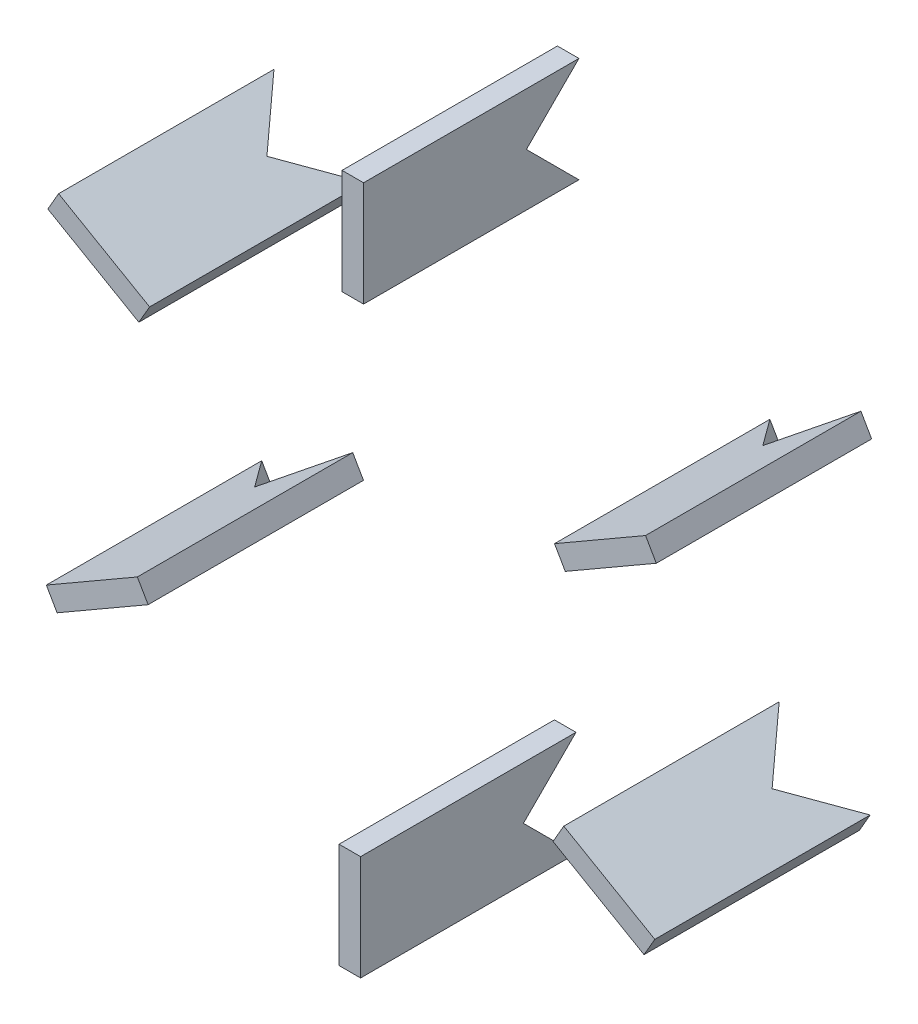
ISO-10303-21;
HEADER;
FILE_DESCRIPTION(('STEP AP214'),'2;1');
FILE_NAME('part.step','',(''),(''),'','','');
FILE_SCHEMA(('AUTOMOTIVE_DESIGN { 1 0 10303 214 1 1 1 1 }'));
ENDSEC;
DATA;
#1=APPLICATION_CONTEXT('core data for automotive mechanical design processes');
#2=APPLICATION_PROTOCOL_DEFINITION('international standard','automotive_design',2000,#1);
#3=PRODUCT_CONTEXT('',#1,'mechanical');
#4=PRODUCT('Part','Part','',(#3));
#5=PRODUCT_RELATED_PRODUCT_CATEGORY('part','',(#4));
#6=PRODUCT_DEFINITION_FORMATION('','',#4);
#7=PRODUCT_DEFINITION_CONTEXT('part definition',#1,'design');
#8=PRODUCT_DEFINITION('design','',#6,#7);
#9=PRODUCT_DEFINITION_SHAPE('','',#8);
#10=(LENGTH_UNIT() NAMED_UNIT(*) SI_UNIT(.MILLI.,.METRE.));
#11=(NAMED_UNIT(*) PLANE_ANGLE_UNIT() SI_UNIT($,.RADIAN.));
#12=(NAMED_UNIT(*) SI_UNIT($,.STERADIAN.) SOLID_ANGLE_UNIT());
#13=UNCERTAINTY_MEASURE_WITH_UNIT(LENGTH_MEASURE(1.E-05),#10,'distance_accuracy_value','');
#14=(GEOMETRIC_REPRESENTATION_CONTEXT(3) GLOBAL_UNCERTAINTY_ASSIGNED_CONTEXT((#13)) GLOBAL_UNIT_ASSIGNED_CONTEXT((#10,
#11,#12)) REPRESENTATION_CONTEXT('',''));
#15=CARTESIAN_POINT('',(0.,0.,0.));
#16=DIRECTION('',(0.,0.,1.));
#17=DIRECTION('',(1.,0.,0.));
#18=AXIS2_PLACEMENT_3D('',#15,#16,#17);
#19=CARTESIAN_POINT('',(0.575310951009,1.25354595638,0.));
#20=DIRECTION('',(0.50000000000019,0.866025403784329,0.));
#21=DIRECTION('',(-0.866025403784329,0.50000000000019,0.));
#22=AXIS2_PLACEMENT_3D('',#19,#20,#21);
#23=PLANE('',#22);
#24=DIRECTION('',(0.,0.,1.));
#25=VECTOR('',#24,1.);
#26=CARTESIAN_POINT('',(-34.1523077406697,21.3035459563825,19.984));
#27=LINE('',#26,#25);
#28=CARTESIAN_POINT('',(-34.1523077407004,21.3035459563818,44.984));
#29=VERTEX_POINT('',#28);
#30=CARTESIAN_POINT('',(-34.152307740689,21.3035459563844,19.9839999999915));
#31=VERTEX_POINT('',#30);
#32=EDGE_CURVE('P0_E88',#29,#31,#27,.F.);
#33=ORIENTED_EDGE('',*,*,#32,.F.);
#34=DIRECTION('',(0.866025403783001,-0.50000000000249,0.));
#35=VECTOR('',#34,1.);
#36=CARTESIAN_POINT('',(-34.1523077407,21.3035459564,44.984));
#37=LINE('',#36,#35);
#38=CARTESIAN_POINT('',(-23.5867978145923,15.2035459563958,44.984));
#39=VERTEX_POINT('',#38);
#40=EDGE_CURVE('P0_E60',#29,#39,#37,.T.);
#41=ORIENTED_EDGE('',*,*,#40,.T.);
#42=DIRECTION('',(0.,0.,1.));
#43=VECTOR('',#42,1.);
#44=CARTESIAN_POINT('',(-23.5867978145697,15.2035459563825,44.984));
#45=LINE('',#44,#43);
#46=CARTESIAN_POINT('',(-23.5867978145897,15.2035459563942,19.9840000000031));
#47=VERTEX_POINT('',#46);
#48=EDGE_CURVE('P0_E56',#47,#39,#45,.T.);
#49=ORIENTED_EDGE('',*,*,#48,.F.);
#50=DIRECTION('',(-0.612372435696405,0.353553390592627,0.707106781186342));
#51=VECTOR('',#50,1.);
#52=CARTESIAN_POINT('',(-23.5867978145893,15.2035459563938,19.9840000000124));
#53=LINE('',#52,#51);
#54=CARTESIAN_POINT('',(-28.869552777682,18.2535459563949,26.0839999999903));
#55=VERTEX_POINT('',#54);
#56=EDGE_CURVE('P0_E73',#47,#55,#53,.T.);
#57=ORIENTED_EDGE('',*,*,#56,.T.);
#58=DIRECTION('',(-0.612372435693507,0.353553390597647,-0.707106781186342));
#59=VECTOR('',#58,1.);
#60=CARTESIAN_POINT('',(-28.8695527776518,18.2535459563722,26.0839999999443));
#61=LINE('',#60,#59);
#62=EDGE_CURVE('P0_E82',#55,#31,#61,.T.);
#63=ORIENTED_EDGE('',*,*,#62,.T.);
#64=EDGE_LOOP('',(#33,#41,#49,#57,#63));
#65=FACE_BOUND('',#64,.T.);
#66=ADVANCED_FACE('P0_F16',(#65),#23,.T.);
#67=CARTESIAN_POINT('',(-24.2117978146,14.1210142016,44.984));
#68=DIRECTION('',(0.866025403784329,-0.50000000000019,0.));
#69=DIRECTION('',(0.50000000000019,0.866025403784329,0.));
#70=AXIS2_PLACEMENT_3D('',#67,#68,#69);
#71=PLANE('',#70);
#72=DIRECTION('',(0.499999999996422,0.866025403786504,3.64847041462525E-12));
#73=VECTOR('',#72,1.);
#74=CARTESIAN_POINT('',(-24.8367978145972,13.0384824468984,19.9840000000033));
#75=LINE('',#74,#73);
#76=CARTESIAN_POINT('',(-24.8367978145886,13.038482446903,19.9840000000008));
#77=VERTEX_POINT('',#76);
#78=EDGE_CURVE('P0_E76',#77,#47,#75,.T.);
#79=ORIENTED_EDGE('',*,*,#78,.T.);
#80=ORIENTED_EDGE('',*,*,#48,.T.);
#81=DIRECTION('',(-0.499999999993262,-0.866025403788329,0.));
#82=VECTOR('',#81,1.);
#83=CARTESIAN_POINT('',(-23.5867978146,15.2035459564,44.984));
#84=LINE('',#83,#82);
#85=CARTESIAN_POINT('',(-24.8367978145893,13.0384824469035,44.984));
#86=VERTEX_POINT('',#85);
#87=EDGE_CURVE('P0_E93',#39,#86,#84,.T.);
#88=ORIENTED_EDGE('',*,*,#87,.T.);
#89=DIRECTION('',(0.,0.,1.));
#90=VECTOR('',#89,1.);
#91=CARTESIAN_POINT('',(-24.8367978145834,13.0384824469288,0.));
#92=LINE('',#91,#90);
#93=EDGE_CURVE('P0_E20',#86,#77,#92,.F.);
#94=ORIENTED_EDGE('',*,*,#93,.T.);
#95=EDGE_LOOP('',(#79,#80,#88,#94));
#96=FACE_BOUND('',#95,.T.);
#97=ADVANCED_FACE('P0_F81',(#96),#71,.T.);
#98=CARTESIAN_POINT('',(-29.4945527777,17.1710142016,26.084));
#99=DIRECTION('',(0.612372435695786,-0.353553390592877,0.707106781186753));
#100=DIRECTION('',(0.755928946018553,0.,-0.654653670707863));
#101=AXIS2_PLACEMENT_3D('',#98,#99,#100);
#102=PLANE('',#101);
#103=DIRECTION('',(-0.612372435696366,0.353553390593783,0.707106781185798));
#104=VECTOR('',#103,1.);
#105=CARTESIAN_POINT('',(-24.8367978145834,13.0384824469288,19.984));
#106=LINE('',#105,#104);
#107=CARTESIAN_POINT('',(-30.1195527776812,16.0884824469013,26.0839999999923));
#108=VERTEX_POINT('',#107);
#109=EDGE_CURVE('P0_E100',#77,#108,#106,.T.);
#110=ORIENTED_EDGE('',*,*,#109,.T.);
#111=DIRECTION('',(0.499999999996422,0.866025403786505,-3.64985819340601E-12));
#112=VECTOR('',#111,1.);
#113=CARTESIAN_POINT('',(-30.1195527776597,16.0884824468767,26.0839999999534));
#114=LINE('',#113,#112);
#115=EDGE_CURVE('P0_E77',#108,#55,#114,.T.);
#116=ORIENTED_EDGE('',*,*,#115,.T.);
#117=ORIENTED_EDGE('',*,*,#56,.F.);
#118=ORIENTED_EDGE('',*,*,#78,.F.);
#119=EDGE_LOOP('',(#110,#116,#117,#118));
#120=FACE_BOUND('',#119,.T.);
#121=ADVANCED_FACE('P0_F75',(#120),#102,.F.);
#122=CARTESIAN_POINT('',(-34.7773077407,20.2210142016,19.984));
#123=DIRECTION('',(-0.612372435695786,0.353553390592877,0.707106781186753));
#124=DIRECTION('',(0.755928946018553,0.,0.654653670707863));
#125=AXIS2_PLACEMENT_3D('',#122,#123,#124);
#126=PLANE('',#125);
#127=DIRECTION('',(-0.612372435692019,0.353553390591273,-0.707106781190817));
#128=VECTOR('',#127,1.);
#129=CARTESIAN_POINT('',(-30.119552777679,16.0884824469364,26.084));
#130=LINE('',#129,#128);
#131=CARTESIAN_POINT('',(-35.4023077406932,19.1384824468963,19.983999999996));
#132=VERTEX_POINT('',#131);
#133=EDGE_CURVE('P0_E98',#108,#132,#130,.T.);
#134=ORIENTED_EDGE('',*,*,#133,.T.);
#135=DIRECTION('',(-0.50000000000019,-0.866025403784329,0.));
#136=VECTOR('',#135,1.);
#137=CARTESIAN_POINT('',(-34.7773077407,20.2210142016,19.984));
#138=LINE('',#137,#136);
#139=EDGE_CURVE('P0_E86',#31,#132,#138,.T.);
#140=ORIENTED_EDGE('',*,*,#139,.F.);
#141=ORIENTED_EDGE('',*,*,#62,.F.);
#142=ORIENTED_EDGE('',*,*,#115,.F.);
#143=EDGE_LOOP('',(#134,#140,#141,#142));
#144=FACE_BOUND('',#143,.T.);
#145=ADVANCED_FACE('P0_F105',(#144),#126,.F.);
#146=CARTESIAN_POINT('',(-34.7773077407,20.2210142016,19.984));
#147=DIRECTION('',(-0.866025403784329,0.50000000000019,0.));
#148=DIRECTION('',(-0.50000000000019,-0.866025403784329,0.));
#149=AXIS2_PLACEMENT_3D('',#146,#147,#148);
#150=PLANE('',#149);
#151=DIRECTION('',(0.499999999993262,0.866025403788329,0.));
#152=VECTOR('',#151,1.);
#153=CARTESIAN_POINT('',(-35.4023077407,19.1384824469,44.984));
#154=LINE('',#153,#152);
#155=CARTESIAN_POINT('',(-35.4023077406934,19.1384824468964,44.984));
#156=VERTEX_POINT('',#155);
#157=EDGE_CURVE('P0_E34',#156,#29,#154,.T.);
#158=ORIENTED_EDGE('',*,*,#157,.T.);
#159=ORIENTED_EDGE('',*,*,#32,.T.);
#160=ORIENTED_EDGE('',*,*,#139,.T.);
#161=DIRECTION('',(0.,0.,1.));
#162=VECTOR('',#161,1.);
#163=CARTESIAN_POINT('',(-35.4023077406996,19.1384824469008,0.));
#164=LINE('',#163,#162);
#165=EDGE_CURVE('P0_E26',#132,#156,#164,.T.);
#166=ORIENTED_EDGE('',*,*,#165,.T.);
#167=EDGE_LOOP('',(#158,#159,#160,#166));
#168=FACE_BOUND('',#167,.T.);
#169=ADVANCED_FACE('P0_F107',(#168),#150,.T.);
#170=CARTESIAN_POINT('',(0.,27.9,44.984));
#171=DIRECTION('',(0.,0.,-1.));
#172=DIRECTION('',(-1.,0.,0.));
#173=AXIS2_PLACEMENT_3D('',#170,#171,#172);
#174=PLANE('',#173);
#175=DIRECTION('',(-0.866025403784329,0.50000000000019,0.));
#176=VECTOR('',#175,1.);
#177=CARTESIAN_POINT('',(-0.674689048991,-0.911517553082,44.984));
#178=LINE('',#177,#176);
#179=EDGE_CURVE('P0_E11',#156,#86,#178,.F.);
#180=ORIENTED_EDGE('',*,*,#179,.T.);
#181=ORIENTED_EDGE('',*,*,#87,.F.);
#182=ORIENTED_EDGE('',*,*,#40,.F.);
#183=ORIENTED_EDGE('',*,*,#157,.F.);
#184=EDGE_LOOP('',(#180,#181,#182,#183));
#185=FACE_BOUND('',#184,.T.);
#186=ADVANCED_FACE('P0_F109',(#185),#174,.F.);
#187=CARTESIAN_POINT('',(-0.674689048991,-0.911517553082,0.));
#188=DIRECTION('',(0.50000000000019,0.866025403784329,0.));
#189=DIRECTION('',(-0.866025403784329,0.50000000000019,0.));
#190=AXIS2_PLACEMENT_3D('',#187,#188,#189);
#191=PLANE('',#190);
#192=ORIENTED_EDGE('',*,*,#165,.F.);
#193=ORIENTED_EDGE('',*,*,#133,.F.);
#194=ORIENTED_EDGE('',*,*,#109,.F.);
#195=ORIENTED_EDGE('',*,*,#93,.F.);
#196=ORIENTED_EDGE('',*,*,#179,.F.);
#197=EDGE_LOOP('',(#192,#193,#194,#195,#196));
#198=FACE_BOUND('',#197,.T.);
#199=ADVANCED_FACE('P0_F18',(#198),#191,.F.);
#200=CLOSED_SHELL('',(#66,#97,#121,#145,#169,#186,#199));
#201=MANIFOLD_SOLID_BREP('P0_B1',#200);
#202=CARTESIAN_POINT('',(-1.59589433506,0.0849502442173,0.));
#203=DIRECTION('',(-1.,0.,0.));
#204=DIRECTION('',(0.,-1.,0.));
#205=AXIS2_PLACEMENT_3D('',#202,#203,#204);
#206=PLANE('',#205);
#207=DIRECTION('',(0.,0.,1.));
#208=VECTOR('',#207,1.);
#209=CARTESIAN_POINT('',(-1.59589433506,-40.0150497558,19.984));
#210=LINE('',#209,#208);
#211=CARTESIAN_POINT('',(-1.59589433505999,-40.0150497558,44.984));
#212=VERTEX_POINT('',#211);
#213=CARTESIAN_POINT('',(-1.59589433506,-40.0150497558,19.984));
#214=VERTEX_POINT('',#213);
#215=EDGE_CURVE('P1_E88',#212,#214,#210,.F.);
#216=ORIENTED_EDGE('',*,*,#215,.F.);
#217=DIRECTION('',(0.,1.,0.));
#218=VECTOR('',#217,1.);
#219=CARTESIAN_POINT('',(-1.59589433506,27.9,44.984));
#220=LINE('',#219,#218);
#221=CARTESIAN_POINT('',(-1.59589433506,-27.8150497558,44.984));
#222=VERTEX_POINT('',#221);
#223=EDGE_CURVE('P1_E60',#212,#222,#220,.T.);
#224=ORIENTED_EDGE('',*,*,#223,.T.);
#225=DIRECTION('',(0.,0.,1.));
#226=VECTOR('',#225,1.);
#227=CARTESIAN_POINT('',(-1.59589433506,-27.8150497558,44.984));
#228=LINE('',#227,#226);
#229=CARTESIAN_POINT('',(-1.59589433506,-27.8150497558,19.984));
#230=VERTEX_POINT('',#229);
#231=EDGE_CURVE('P1_E56',#230,#222,#228,.T.);
#232=ORIENTED_EDGE('',*,*,#231,.F.);
#233=DIRECTION('',(0.,-0.707106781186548,0.707106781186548));
#234=VECTOR('',#233,1.);
#235=CARTESIAN_POINT('',(-1.59589433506,-33.9150497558,26.084));
#236=LINE('',#235,#234);
#237=CARTESIAN_POINT('',(-1.59589433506,-33.9150497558,26.084));
#238=VERTEX_POINT('',#237);
#239=EDGE_CURVE('P1_E73',#230,#238,#236,.T.);
#240=ORIENTED_EDGE('',*,*,#239,.T.);
#241=DIRECTION('',(0.,-0.707106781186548,-0.707106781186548));
#242=VECTOR('',#241,1.);
#243=CARTESIAN_POINT('',(-1.59589433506,-40.0150497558,19.984));
#244=LINE('',#243,#242);
#245=EDGE_CURVE('P1_E82',#238,#214,#244,.T.);
#246=ORIENTED_EDGE('',*,*,#245,.T.);
#247=EDGE_LOOP('',(#216,#224,#232,#240,#246));
#248=FACE_BOUND('',#247,.T.);
#249=ADVANCED_FACE('P1_F16',(#248),#206,.T.);
#250=CARTESIAN_POINT('',(-0.345894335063,-27.8150497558,44.984));
#251=DIRECTION('',(0.,1.,0.));
#252=DIRECTION('',(-1.,0.,0.));
#253=AXIS2_PLACEMENT_3D('',#250,#251,#252);
#254=PLANE('',#253);
#255=DIRECTION('',(1.,0.,0.));
#256=VECTOR('',#255,1.);
#257=CARTESIAN_POINT('',(-0.345894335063,-27.8150497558,19.984));
#258=LINE('',#257,#256);
#259=CARTESIAN_POINT('',(0.904105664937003,-27.8150497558,19.984));
#260=VERTEX_POINT('',#259);
#261=EDGE_CURVE('P1_E76',#260,#230,#258,.F.);
#262=ORIENTED_EDGE('',*,*,#261,.T.);
#263=ORIENTED_EDGE('',*,*,#231,.T.);
#264=DIRECTION('',(-1.,0.,0.));
#265=VECTOR('',#264,1.);
#266=CARTESIAN_POINT('',(0.,-27.8150497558,44.984));
#267=LINE('',#266,#265);
#268=CARTESIAN_POINT('',(0.904105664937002,-27.8150497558,44.984));
#269=VERTEX_POINT('',#268);
#270=EDGE_CURVE('P1_E93',#222,#269,#267,.F.);
#271=ORIENTED_EDGE('',*,*,#270,.T.);
#272=DIRECTION('',(0.,0.,1.));
#273=VECTOR('',#272,1.);
#274=CARTESIAN_POINT('',(0.904105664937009,-27.8150497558,0.));
#275=LINE('',#274,#273);
#276=EDGE_CURVE('P1_E20',#269,#260,#275,.F.);
#277=ORIENTED_EDGE('',*,*,#276,.T.);
#278=EDGE_LOOP('',(#262,#263,#271,#277));
#279=FACE_BOUND('',#278,.T.);
#280=ADVANCED_FACE('P1_F81',(#279),#254,.T.);
#281=CARTESIAN_POINT('',(-0.345894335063,-33.9150497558,26.084));
#282=DIRECTION('',(0.,0.707106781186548,0.707106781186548));
#283=DIRECTION('',(0.,-0.707106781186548,0.707106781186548));
#284=AXIS2_PLACEMENT_3D('',#281,#282,#283);
#285=PLANE('',#284);
#286=DIRECTION('',(0.,-0.707106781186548,0.707106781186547));
#287=VECTOR('',#286,1.);
#288=CARTESIAN_POINT('',(0.904105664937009,-27.8150497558,19.984));
#289=LINE('',#288,#287);
#290=CARTESIAN_POINT('',(0.904105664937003,-33.9150497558,26.084));
#291=VERTEX_POINT('',#290);
#292=EDGE_CURVE('P1_E100',#260,#291,#289,.T.);
#293=ORIENTED_EDGE('',*,*,#292,.T.);
#294=DIRECTION('',(1.,0.,0.));
#295=VECTOR('',#294,1.);
#296=CARTESIAN_POINT('',(-0.345894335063,-33.9150497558,26.084));
#297=LINE('',#296,#295);
#298=EDGE_CURVE('P1_E77',#291,#238,#297,.F.);
#299=ORIENTED_EDGE('',*,*,#298,.T.);
#300=ORIENTED_EDGE('',*,*,#239,.F.);
#301=ORIENTED_EDGE('',*,*,#261,.F.);
#302=EDGE_LOOP('',(#293,#299,#300,#301));
#303=FACE_BOUND('',#302,.T.);
#304=ADVANCED_FACE('P1_F75',(#303),#285,.F.);
#305=CARTESIAN_POINT('',(-0.345894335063,-40.0150497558,19.984));
#306=DIRECTION('',(0.,-0.707106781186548,0.707106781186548));
#307=DIRECTION('',(0.,-0.707106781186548,-0.707106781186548));
#308=AXIS2_PLACEMENT_3D('',#305,#306,#307);
#309=PLANE('',#308);
#310=DIRECTION('',(0.,-0.707106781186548,-0.707106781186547));
#311=VECTOR('',#310,1.);
#312=CARTESIAN_POINT('',(0.904105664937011,-33.9150497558,26.084));
#313=LINE('',#312,#311);
#314=CARTESIAN_POINT('',(0.904105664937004,-40.0150497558,19.984));
#315=VERTEX_POINT('',#314);
#316=EDGE_CURVE('P1_E98',#291,#315,#313,.T.);
#317=ORIENTED_EDGE('',*,*,#316,.T.);
#318=DIRECTION('',(1.,0.,0.));
#319=VECTOR('',#318,1.);
#320=CARTESIAN_POINT('',(-0.345894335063,-40.0150497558,19.984));
#321=LINE('',#320,#319);
#322=EDGE_CURVE('P1_E86',#214,#315,#321,.T.);
#323=ORIENTED_EDGE('',*,*,#322,.F.);
#324=ORIENTED_EDGE('',*,*,#245,.F.);
#325=ORIENTED_EDGE('',*,*,#298,.F.);
#326=EDGE_LOOP('',(#317,#323,#324,#325));
#327=FACE_BOUND('',#326,.T.);
#328=ADVANCED_FACE('P1_F105',(#327),#309,.F.);
#329=CARTESIAN_POINT('',(-0.345894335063,-40.0150497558,19.984));
#330=DIRECTION('',(0.,-1.,0.));
#331=DIRECTION('',(1.,0.,0.));
#332=AXIS2_PLACEMENT_3D('',#329,#330,#331);
#333=PLANE('',#332);
#334=DIRECTION('',(-1.,0.,0.));
#335=VECTOR('',#334,1.);
#336=CARTESIAN_POINT('',(0.,-40.0150497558,44.984));
#337=LINE('',#336,#335);
#338=CARTESIAN_POINT('',(0.904105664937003,-40.0150497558,44.984));
#339=VERTEX_POINT('',#338);
#340=EDGE_CURVE('P1_E34',#339,#212,#337,.T.);
#341=ORIENTED_EDGE('',*,*,#340,.T.);
#342=ORIENTED_EDGE('',*,*,#215,.T.);
#343=ORIENTED_EDGE('',*,*,#322,.T.);
#344=DIRECTION('',(0.,0.,1.));
#345=VECTOR('',#344,1.);
#346=CARTESIAN_POINT('',(0.904105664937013,-40.0150497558,0.));
#347=LINE('',#346,#345);
#348=EDGE_CURVE('P1_E26',#315,#339,#347,.T.);
#349=ORIENTED_EDGE('',*,*,#348,.T.);
#350=EDGE_LOOP('',(#341,#342,#343,#349));
#351=FACE_BOUND('',#350,.T.);
#352=ADVANCED_FACE('P1_F107',(#351),#333,.T.);
#353=CARTESIAN_POINT('',(0.,27.9,44.984));
#354=DIRECTION('',(0.,0.,-1.));
#355=DIRECTION('',(-1.,0.,0.));
#356=AXIS2_PLACEMENT_3D('',#353,#354,#355);
#357=PLANE('',#356);
#358=DIRECTION('',(0.,-1.,0.));
#359=VECTOR('',#358,1.);
#360=CARTESIAN_POINT('',(0.904105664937,0.0849502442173,44.984));
#361=LINE('',#360,#359);
#362=EDGE_CURVE('P1_E11',#339,#269,#361,.F.);
#363=ORIENTED_EDGE('',*,*,#362,.T.);
#364=ORIENTED_EDGE('',*,*,#270,.F.);
#365=ORIENTED_EDGE('',*,*,#223,.F.);
#366=ORIENTED_EDGE('',*,*,#340,.F.);
#367=EDGE_LOOP('',(#363,#364,#365,#366));
#368=FACE_BOUND('',#367,.T.);
#369=ADVANCED_FACE('P1_F109',(#368),#357,.F.);
#370=CARTESIAN_POINT('',(0.904105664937,0.0849502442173,0.));
#371=DIRECTION('',(-1.,0.,0.));
#372=DIRECTION('',(0.,-1.,0.));
#373=AXIS2_PLACEMENT_3D('',#370,#371,#372);
#374=PLANE('',#373);
#375=ORIENTED_EDGE('',*,*,#348,.F.);
#376=ORIENTED_EDGE('',*,*,#316,.F.);
#377=ORIENTED_EDGE('',*,*,#292,.F.);
#378=ORIENTED_EDGE('',*,*,#276,.F.);
#379=ORIENTED_EDGE('',*,*,#362,.F.);
#380=EDGE_LOOP('',(#375,#376,#377,#378,#379));
#381=FACE_BOUND('',#380,.T.);
#382=ADVANCED_FACE('P1_F18',(#381),#374,.F.);
#383=CLOSED_SHELL('',(#249,#280,#304,#328,#352,#369,#382));
#384=MANIFOLD_SOLID_BREP('P1_B1',#383);
#385=CARTESIAN_POINT('',(0.402363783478,-0.869042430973,0.));
#386=DIRECTION('',(-0.50000000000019,0.866025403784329,0.));
#387=DIRECTION('',(-0.866025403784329,-0.50000000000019,0.));
#388=AXIS2_PLACEMENT_3D('',#385,#386,#387);
#389=PLANE('',#388);
#390=DIRECTION('',(0.,0.,1.));
#391=VECTOR('',#390,1.);
#392=CARTESIAN_POINT('',(-34.3252549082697,-20.9190424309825,19.984));
#393=LINE('',#392,#391);
#394=CARTESIAN_POINT('',(-34.3252549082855,-20.9190424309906,19.9839999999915));
#395=VERTEX_POINT('',#394);
#396=CARTESIAN_POINT('',(-34.3252549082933,-20.9190424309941,44.984));
#397=VERTEX_POINT('',#396);
#398=EDGE_CURVE('P2_E91',#395,#397,#393,.T.);
#399=ORIENTED_EDGE('',*,*,#398,.F.);
#400=DIRECTION('',(0.612372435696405,0.353553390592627,0.707106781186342));
#401=VECTOR('',#400,1.);
#402=CARTESIAN_POINT('',(-34.3252549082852,-20.9190424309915,19.9839999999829));
#403=LINE('',#402,#401);
#404=CARTESIAN_POINT('',(-29.0424999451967,-17.869042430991,26.0840000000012));
#405=VERTEX_POINT('',#404);
#406=EDGE_CURVE('P2_E72',#395,#405,#403,.T.);
#407=ORIENTED_EDGE('',*,*,#406,.T.);
#408=DIRECTION('',(0.612372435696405,0.353553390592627,-0.707106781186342));
#409=VECTOR('',#408,1.);
#410=CARTESIAN_POINT('',(-29.0424999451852,-17.8690424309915,26.0840000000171));
#411=LINE('',#410,#409);
#412=CARTESIAN_POINT('',(-23.759744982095,-14.8190424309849,19.9840000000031));
#413=VERTEX_POINT('',#412);
#414=EDGE_CURVE('P2_E69',#405,#413,#411,.T.);
#415=ORIENTED_EDGE('',*,*,#414,.T.);
#416=DIRECTION('',(0.,0.,1.));
#417=VECTOR('',#416,1.);
#418=CARTESIAN_POINT('',(-23.7597449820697,-14.8190424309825,44.984));
#419=LINE('',#418,#417);
#420=CARTESIAN_POINT('',(-23.7597449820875,-14.8190424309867,44.984));
#421=VERTEX_POINT('',#420);
#422=EDGE_CURVE('P2_E71',#421,#413,#419,.F.);
#423=ORIENTED_EDGE('',*,*,#422,.F.);
#424=DIRECTION('',(-0.86602540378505,-0.49999999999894,0.));
#425=VECTOR('',#424,1.);
#426=CARTESIAN_POINT('',(-23.7597449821,-14.819042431,44.984));
#427=LINE('',#426,#425);
#428=EDGE_CURVE('P2_E58',#421,#397,#427,.T.);
#429=ORIENTED_EDGE('',*,*,#428,.T.);
#430=EDGE_LOOP('',(#399,#407,#415,#423,#429));
#431=FACE_BOUND('',#430,.T.);
#432=ADVANCED_FACE('P2_F16',(#431),#389,.F.);
#433=CARTESIAN_POINT('',(-24.3847449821,-13.7365106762,44.984));
#434=DIRECTION('',(0.866025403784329,0.50000000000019,0.));
#435=DIRECTION('',(-0.50000000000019,0.866025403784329,0.));
#436=AXIS2_PLACEMENT_3D('',#433,#434,#435);
#437=PLANE('',#436);
#438=DIRECTION('',(-0.499999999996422,0.866025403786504,-3.64985819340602E-12));
#439=VECTOR('',#438,1.);
#440=CARTESIAN_POINT('',(-23.7597449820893,-14.8190424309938,19.9840000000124));
#441=LINE('',#440,#439);
#442=CARTESIAN_POINT('',(-25.0097449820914,-12.6539789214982,19.9840000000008));
#443=VERTEX_POINT('',#442);
#444=EDGE_CURVE('P2_E76',#413,#443,#441,.T.);
#445=ORIENTED_EDGE('',*,*,#444,.T.);
#446=DIRECTION('',(0.,0.,1.));
#447=VECTOR('',#446,1.);
#448=CARTESIAN_POINT('',(-25.0097449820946,-12.6539789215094,0.));
#449=LINE('',#448,#447);
#450=CARTESIAN_POINT('',(-25.0097449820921,-12.6539789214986,44.984));
#451=VERTEX_POINT('',#450);
#452=EDGE_CURVE('P2_E20',#451,#443,#449,.F.);
#453=ORIENTED_EDGE('',*,*,#452,.F.);
#454=DIRECTION('',(0.499999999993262,-0.866025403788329,0.));
#455=VECTOR('',#454,1.);
#456=CARTESIAN_POINT('',(-25.0097449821,-12.6539789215,44.984));
#457=LINE('',#456,#455);
#458=EDGE_CURVE('P2_E80',#451,#421,#457,.T.);
#459=ORIENTED_EDGE('',*,*,#458,.T.);
#460=ORIENTED_EDGE('',*,*,#422,.T.);
#461=EDGE_LOOP('',(#445,#453,#459,#460));
#462=FACE_BOUND('',#461,.T.);
#463=ADVANCED_FACE('P2_F78',(#462),#437,.T.);
#464=CARTESIAN_POINT('',(-29.6674999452,-16.7865106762,26.084));
#465=DIRECTION('',(0.612372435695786,0.353553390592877,0.707106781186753));
#466=DIRECTION('',(0.755928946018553,0.,-0.654653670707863));
#467=AXIS2_PLACEMENT_3D('',#464,#465,#466);
#468=PLANE('',#467);
#469=ORIENTED_EDGE('',*,*,#414,.F.);
#470=DIRECTION('',(-0.499999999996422,0.866025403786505,3.64985819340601E-12));
#471=VECTOR('',#470,1.);
#472=CARTESIAN_POINT('',(-29.0424999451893,-17.8690424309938,26.0839999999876));
#473=LINE('',#472,#471);
#474=CARTESIAN_POINT('',(-30.2924999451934,-15.7039789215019,26.0840000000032));
#475=VERTEX_POINT('',#474);
#476=EDGE_CURVE('P2_E86',#405,#475,#473,.T.);
#477=ORIENTED_EDGE('',*,*,#476,.T.);
#478=DIRECTION('',(-0.612372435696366,-0.353553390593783,0.707106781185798));
#479=VECTOR('',#478,1.);
#480=CARTESIAN_POINT('',(-25.0097449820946,-12.6539789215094,19.984));
#481=LINE('',#480,#479);
#482=EDGE_CURVE('P2_E84',#443,#475,#481,.T.);
#483=ORIENTED_EDGE('',*,*,#482,.F.);
#484=ORIENTED_EDGE('',*,*,#444,.F.);
#485=EDGE_LOOP('',(#469,#477,#483,#484));
#486=FACE_BOUND('',#485,.T.);
#487=ADVANCED_FACE('P2_F82',(#486),#468,.F.);
#488=CARTESIAN_POINT('',(-34.9502549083,-19.8365106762,19.984));
#489=DIRECTION('',(-0.612372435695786,-0.353553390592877,0.707106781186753));
#490=DIRECTION('',(0.755928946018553,0.,0.654653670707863));
#491=AXIS2_PLACEMENT_3D('',#488,#489,#490);
#492=PLANE('',#491);
#493=ORIENTED_EDGE('',*,*,#406,.F.);
#494=DIRECTION('',(0.50000000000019,-0.866025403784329,0.));
#495=VECTOR('',#494,1.);
#496=CARTESIAN_POINT('',(-34.9502549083,-19.8365106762,19.984));
#497=LINE('',#496,#495);
#498=CARTESIAN_POINT('',(-35.5752549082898,-18.7539789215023,19.983999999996));
#499=VERTEX_POINT('',#498);
#500=EDGE_CURVE('P2_E89',#499,#395,#497,.T.);
#501=ORIENTED_EDGE('',*,*,#500,.F.);
#502=DIRECTION('',(-0.612372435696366,-0.353553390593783,-0.707106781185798));
#503=VECTOR('',#502,1.);
#504=CARTESIAN_POINT('',(-30.2924999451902,-15.703978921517,26.084));
#505=LINE('',#504,#503);
#506=EDGE_CURVE('P2_E100',#475,#499,#505,.T.);
#507=ORIENTED_EDGE('',*,*,#506,.F.);
#508=ORIENTED_EDGE('',*,*,#476,.F.);
#509=EDGE_LOOP('',(#493,#501,#507,#508));
#510=FACE_BOUND('',#509,.T.);
#511=ADVANCED_FACE('P2_F112',(#510),#492,.F.);
#512=CARTESIAN_POINT('',(-34.9502549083,-19.8365106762,19.984));
#513=DIRECTION('',(-0.866025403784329,-0.50000000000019,0.));
#514=DIRECTION('',(0.50000000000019,-0.866025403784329,0.));
#515=AXIS2_PLACEMENT_3D('',#512,#513,#514);
#516=PLANE('',#515);
#517=DIRECTION('',(-0.499999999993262,0.866025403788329,0.));
#518=VECTOR('',#517,1.);
#519=CARTESIAN_POINT('',(-34.3252549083,-20.919042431,44.984));
#520=LINE('',#519,#518);
#521=CARTESIAN_POINT('',(-35.57525490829,-18.7539789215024,44.984));
#522=VERTEX_POINT('',#521);
#523=EDGE_CURVE('P2_E35',#397,#522,#520,.T.);
#524=ORIENTED_EDGE('',*,*,#523,.T.);
#525=DIRECTION('',(0.,0.,1.));
#526=VECTOR('',#525,1.);
#527=CARTESIAN_POINT('',(-35.5752549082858,-18.7539789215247,0.));
#528=LINE('',#527,#526);
#529=EDGE_CURVE('P2_E26',#499,#522,#528,.T.);
#530=ORIENTED_EDGE('',*,*,#529,.F.);
#531=ORIENTED_EDGE('',*,*,#500,.T.);
#532=ORIENTED_EDGE('',*,*,#398,.T.);
#533=EDGE_LOOP('',(#524,#530,#531,#532));
#534=FACE_BOUND('',#533,.T.);
#535=ADVANCED_FACE('P2_F106',(#534),#516,.T.);
#536=CARTESIAN_POINT('',(0.,27.9,44.984));
#537=DIRECTION('',(0.,0.,-1.));
#538=DIRECTION('',(-1.,0.,0.));
#539=AXIS2_PLACEMENT_3D('',#536,#537,#538);
#540=PLANE('',#539);
#541=ORIENTED_EDGE('',*,*,#428,.F.);
#542=ORIENTED_EDGE('',*,*,#458,.F.);
#543=DIRECTION('',(-0.866025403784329,-0.50000000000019,0.));
#544=VECTOR('',#543,1.);
#545=CARTESIAN_POINT('',(-0.847636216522,1.29602107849,44.984));
#546=LINE('',#545,#544);
#547=EDGE_CURVE('P2_E11',#522,#451,#546,.F.);
#548=ORIENTED_EDGE('',*,*,#547,.F.);
#549=ORIENTED_EDGE('',*,*,#523,.F.);
#550=EDGE_LOOP('',(#541,#542,#548,#549));
#551=FACE_BOUND('',#550,.T.);
#552=ADVANCED_FACE('P2_F104',(#551),#540,.F.);
#553=CARTESIAN_POINT('',(-0.847636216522,1.29602107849,0.));
#554=DIRECTION('',(-0.50000000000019,0.866025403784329,0.));
#555=DIRECTION('',(-0.866025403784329,-0.50000000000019,0.));
#556=AXIS2_PLACEMENT_3D('',#553,#554,#555);
#557=PLANE('',#556);
#558=ORIENTED_EDGE('',*,*,#529,.T.);
#559=ORIENTED_EDGE('',*,*,#547,.T.);
#560=ORIENTED_EDGE('',*,*,#452,.T.);
#561=ORIENTED_EDGE('',*,*,#482,.T.);
#562=ORIENTED_EDGE('',*,*,#506,.T.);
#563=EDGE_LOOP('',(#558,#559,#560,#561,#562));
#564=FACE_BOUND('',#563,.T.);
#565=ADVANCED_FACE('P2_F18',(#564),#557,.T.);
#566=CLOSED_SHELL('',(#432,#463,#487,#511,#535,#552,#565));
#567=MANIFOLD_SOLID_BREP('P2_B1',#566);
#568=CARTESIAN_POINT('',(0.328794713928,0.996467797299,0.));
#569=DIRECTION('',(-0.50000000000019,-0.866025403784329,0.));
#570=DIRECTION('',(0.866025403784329,-0.50000000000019,0.));
#571=AXIS2_PLACEMENT_3D('',#568,#569,#570);
#572=PLANE('',#571);
#573=DIRECTION('',(0.,0.,1.));
#574=VECTOR('',#573,1.);
#575=CARTESIAN_POINT('',(35.056413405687,-19.0535322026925,19.984));
#576=LINE('',#575,#574);
#577=CARTESIAN_POINT('',(35.0564134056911,-19.0535322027,19.983999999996));
#578=VERTEX_POINT('',#577);
#579=CARTESIAN_POINT('',(35.0564134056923,-19.0535322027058,44.984));
#580=VERTEX_POINT('',#579);
#581=EDGE_CURVE('P3_E91',#578,#580,#576,.T.);
#582=ORIENTED_EDGE('',*,*,#581,.F.);
#583=DIRECTION('',(-0.612372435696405,0.353553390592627,0.707106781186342));
#584=VECTOR('',#583,1.);
#585=CARTESIAN_POINT('',(35.0564134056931,-19.053532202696,19.9839999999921));
#586=LINE('',#585,#584);
#587=CARTESIAN_POINT('',(29.7736584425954,-16.0035322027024,26.0840000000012));
#588=VERTEX_POINT('',#587);
#589=EDGE_CURVE('P3_E72',#578,#588,#586,.T.);
#590=ORIENTED_EDGE('',*,*,#589,.T.);
#591=DIRECTION('',(-0.612372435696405,0.353553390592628,-0.707106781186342));
#592=VECTOR('',#591,1.);
#593=CARTESIAN_POINT('',(29.7736584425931,-16.003532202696,26.0840000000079));
#594=LINE('',#593,#592);
#595=CARTESIAN_POINT('',(24.490903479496,-12.9535322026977,19.9840000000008));
#596=VERTEX_POINT('',#595);
#597=EDGE_CURVE('P3_E69',#588,#596,#594,.T.);
#598=ORIENTED_EDGE('',*,*,#597,.T.);
#599=DIRECTION('',(0.,0.,1.));
#600=VECTOR('',#599,1.);
#601=CARTESIAN_POINT('',(24.490903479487,-12.9535322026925,44.984));
#602=LINE('',#601,#600);
#603=CARTESIAN_POINT('',(24.4909034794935,-12.9535322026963,44.984));
#604=VERTEX_POINT('',#603);
#605=EDGE_CURVE('P3_E71',#604,#596,#602,.F.);
#606=ORIENTED_EDGE('',*,*,#605,.F.);
#607=DIRECTION('',(0.86602540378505,-0.499999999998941,0.));
#608=VECTOR('',#607,1.);
#609=CARTESIAN_POINT('',(24.4909034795,-12.9535322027,44.984));
#610=LINE('',#609,#608);
#611=EDGE_CURVE('P3_E58',#604,#580,#610,.T.);
#612=ORIENTED_EDGE('',*,*,#611,.T.);
#613=EDGE_LOOP('',(#582,#590,#598,#606,#612));
#614=FACE_BOUND('',#613,.T.);
#615=ADVANCED_FACE('P3_F16',(#614),#572,.F.);
#616=CARTESIAN_POINT('',(23.8659034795,-14.0360639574,44.984));
#617=DIRECTION('',(-0.866025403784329,0.50000000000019,0.));
#618=DIRECTION('',(-0.50000000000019,-0.866025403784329,0.));
#619=AXIS2_PLACEMENT_3D('',#616,#617,#618);
#620=PLANE('',#619);
#621=DIRECTION('',(-0.499999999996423,-0.866025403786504,3.64847041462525E-12));
#622=VECTOR('',#621,1.);
#623=CARTESIAN_POINT('',(24.4909034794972,-12.9535322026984,19.9840000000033));
#624=LINE('',#623,#622);
#625=CARTESIAN_POINT('',(23.2409034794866,-15.118595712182,19.9840000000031));
#626=VERTEX_POINT('',#625);
#627=EDGE_CURVE('P3_E76',#596,#626,#624,.T.);
#628=ORIENTED_EDGE('',*,*,#627,.T.);
#629=DIRECTION('',(0.,0.,1.));
#630=VECTOR('',#629,1.);
#631=CARTESIAN_POINT('',(23.2409034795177,-15.1185957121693,0.));
#632=LINE('',#631,#630);
#633=CARTESIAN_POINT('',(23.2409034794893,-15.1185957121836,44.984));
#634=VERTEX_POINT('',#633);
#635=EDGE_CURVE('P3_E20',#634,#626,#632,.F.);
#636=ORIENTED_EDGE('',*,*,#635,.F.);
#637=DIRECTION('',(0.499999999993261,0.866025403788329,0.));
#638=VECTOR('',#637,1.);
#639=CARTESIAN_POINT('',(23.2409034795,-15.1185957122,44.984));
#640=LINE('',#639,#638);
#641=EDGE_CURVE('P3_E80',#634,#604,#640,.T.);
#642=ORIENTED_EDGE('',*,*,#641,.T.);
#643=ORIENTED_EDGE('',*,*,#605,.T.);
#644=EDGE_LOOP('',(#628,#636,#642,#643));
#645=FACE_BOUND('',#644,.T.);
#646=ADVANCED_FACE('P3_F78',(#645),#620,.T.);
#647=CARTESIAN_POINT('',(29.1486584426,-17.0860639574,26.084));
#648=DIRECTION('',(-0.612372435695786,0.353553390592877,0.707106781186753));
#649=DIRECTION('',(0.755928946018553,0.,0.654653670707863));
#650=AXIS2_PLACEMENT_3D('',#647,#648,#649);
#651=PLANE('',#650);
#652=ORIENTED_EDGE('',*,*,#597,.F.);
#653=DIRECTION('',(-0.499999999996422,-0.866025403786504,-3.64985819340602E-12));
#654=VECTOR('',#653,1.);
#655=CARTESIAN_POINT('',(29.7736584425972,-16.0035322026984,26.0839999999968));
#656=LINE('',#655,#654);
#657=CARTESIAN_POINT('',(28.5236584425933,-18.1685957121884,26.0840000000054));
#658=VERTEX_POINT('',#657);
#659=EDGE_CURVE('P3_E86',#588,#658,#656,.T.);
#660=ORIENTED_EDGE('',*,*,#659,.T.);
#661=DIRECTION('',(0.612372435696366,-0.353553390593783,0.707106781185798));
#662=VECTOR('',#661,1.);
#663=CARTESIAN_POINT('',(23.2409034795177,-15.1185957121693,19.984));
#664=LINE('',#663,#662);
#665=EDGE_CURVE('P3_E84',#626,#658,#664,.T.);
#666=ORIENTED_EDGE('',*,*,#665,.F.);
#667=ORIENTED_EDGE('',*,*,#627,.F.);
#668=EDGE_LOOP('',(#652,#660,#666,#667));
#669=FACE_BOUND('',#668,.T.);
#670=ADVANCED_FACE('P3_F82',(#669),#651,.F.);
#671=CARTESIAN_POINT('',(34.4314134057,-20.1360639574,19.984));
#672=DIRECTION('',(0.612372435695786,-0.353553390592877,0.707106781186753));
#673=DIRECTION('',(0.755928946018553,0.,-0.654653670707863));
#674=AXIS2_PLACEMENT_3D('',#671,#672,#673);
#675=PLANE('',#674);
#676=ORIENTED_EDGE('',*,*,#589,.F.);
#677=DIRECTION('',(0.50000000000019,0.866025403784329,0.));
#678=VECTOR('',#677,1.);
#679=CARTESIAN_POINT('',(34.4314134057,-20.1360639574,19.984));
#680=LINE('',#679,#678);
#681=CARTESIAN_POINT('',(33.8064134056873,-21.2185957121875,19.9839999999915));
#682=VERTEX_POINT('',#681);
#683=EDGE_CURVE('P3_E89',#682,#578,#680,.T.);
#684=ORIENTED_EDGE('',*,*,#683,.F.);
#685=DIRECTION('',(0.612372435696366,-0.353553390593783,-0.707106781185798));
#686=VECTOR('',#685,1.);
#687=CARTESIAN_POINT('',(28.5236584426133,-18.1685957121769,26.084));
#688=LINE('',#687,#686);
#689=EDGE_CURVE('P3_E100',#658,#682,#688,.T.);
#690=ORIENTED_EDGE('',*,*,#689,.F.);
#691=ORIENTED_EDGE('',*,*,#659,.F.);
#692=EDGE_LOOP('',(#676,#684,#690,#691));
#693=FACE_BOUND('',#692,.T.);
#694=ADVANCED_FACE('P3_F112',(#693),#675,.F.);
#695=CARTESIAN_POINT('',(34.4314134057,-20.1360639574,19.984));
#696=DIRECTION('',(0.866025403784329,-0.50000000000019,0.));
#697=DIRECTION('',(0.50000000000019,0.866025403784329,0.));
#698=AXIS2_PLACEMENT_3D('',#695,#696,#697);
#699=PLANE('',#698);
#700=DIRECTION('',(-0.499999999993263,-0.866025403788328,0.));
#701=VECTOR('',#700,1.);
#702=CARTESIAN_POINT('',(35.0564134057,-19.0535322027,44.984));
#703=LINE('',#702,#701);
#704=CARTESIAN_POINT('',(33.8064134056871,-21.2185957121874,44.984));
#705=VERTEX_POINT('',#704);
#706=EDGE_CURVE('P3_E35',#580,#705,#703,.T.);
#707=ORIENTED_EDGE('',*,*,#706,.T.);
#708=DIRECTION('',(0.,0.,1.));
#709=VECTOR('',#708,1.);
#710=CARTESIAN_POINT('',(33.8064134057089,-21.2185957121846,0.));
#711=LINE('',#710,#709);
#712=EDGE_CURVE('P3_E26',#682,#705,#711,.T.);
#713=ORIENTED_EDGE('',*,*,#712,.F.);
#714=ORIENTED_EDGE('',*,*,#683,.T.);
#715=ORIENTED_EDGE('',*,*,#581,.T.);
#716=EDGE_LOOP('',(#707,#713,#714,#715));
#717=FACE_BOUND('',#716,.T.);
#718=ADVANCED_FACE('P3_F106',(#717),#699,.T.);
#719=CARTESIAN_POINT('',(0.,27.9,44.984));
#720=DIRECTION('',(0.,0.,-1.));
#721=DIRECTION('',(-1.,0.,0.));
#722=AXIS2_PLACEMENT_3D('',#719,#720,#721);
#723=PLANE('',#722);
#724=ORIENTED_EDGE('',*,*,#611,.F.);
#725=ORIENTED_EDGE('',*,*,#641,.F.);
#726=DIRECTION('',(0.866025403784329,-0.50000000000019,0.));
#727=VECTOR('',#726,1.);
#728=CARTESIAN_POINT('',(-0.921205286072,-1.16859571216,44.984));
#729=LINE('',#728,#727);
#730=EDGE_CURVE('P3_E11',#705,#634,#729,.F.);
#731=ORIENTED_EDGE('',*,*,#730,.F.);
#732=ORIENTED_EDGE('',*,*,#706,.F.);
#733=EDGE_LOOP('',(#724,#725,#731,#732));
#734=FACE_BOUND('',#733,.T.);
#735=ADVANCED_FACE('P3_F104',(#734),#723,.F.);
#736=CARTESIAN_POINT('',(-0.921205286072,-1.16859571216,0.));
#737=DIRECTION('',(-0.50000000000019,-0.866025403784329,0.));
#738=DIRECTION('',(0.866025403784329,-0.50000000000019,0.));
#739=AXIS2_PLACEMENT_3D('',#736,#737,#738);
#740=PLANE('',#739);
#741=ORIENTED_EDGE('',*,*,#712,.T.);
#742=ORIENTED_EDGE('',*,*,#730,.T.);
#743=ORIENTED_EDGE('',*,*,#635,.T.);
#744=ORIENTED_EDGE('',*,*,#665,.T.);
#745=ORIENTED_EDGE('',*,*,#689,.T.);
#746=EDGE_LOOP('',(#741,#742,#743,#744,#745));
#747=FACE_BOUND('',#746,.T.);
#748=ADVANCED_FACE('P3_F18',(#747),#740,.T.);
#749=CLOSED_SHELL('',(#615,#646,#670,#694,#718,#735,#748));
#750=MANIFOLD_SOLID_BREP('P3_B1',#749);
#751=CARTESIAN_POINT('',(1.25,0.,0.));
#752=DIRECTION('',(1.,0.,0.));
#753=DIRECTION('',(0.,0.,-1.));
#754=AXIS2_PLACEMENT_3D('',#751,#752,#753);
#755=PLANE('',#754);
#756=DIRECTION('',(0.,0.,1.));
#757=VECTOR('',#756,1.);
#758=CARTESIAN_POINT('',(1.25,40.1,19.984));
#759=LINE('',#758,#757);
#760=CARTESIAN_POINT('',(1.25,40.1,44.984));
#761=VERTEX_POINT('',#760);
#762=CARTESIAN_POINT('',(1.25,40.1,19.984));
#763=VERTEX_POINT('',#762);
#764=EDGE_CURVE('P4_E88',#761,#763,#759,.F.);
#765=ORIENTED_EDGE('',*,*,#764,.F.);
#766=DIRECTION('',(0.,1.,0.));
#767=VECTOR('',#766,1.);
#768=CARTESIAN_POINT('',(1.25,27.9,44.984));
#769=LINE('',#768,#767);
#770=CARTESIAN_POINT('',(1.25,27.9,44.984));
#771=VERTEX_POINT('',#770);
#772=EDGE_CURVE('P4_E60',#761,#771,#769,.F.);
#773=ORIENTED_EDGE('',*,*,#772,.T.);
#774=DIRECTION('',(0.,0.,-1.));
#775=VECTOR('',#774,1.);
#776=CARTESIAN_POINT('',(1.25,27.9,44.984));
#777=LINE('',#776,#775);
#778=CARTESIAN_POINT('',(1.25,27.9,19.984));
#779=VERTEX_POINT('',#778);
#780=EDGE_CURVE('P4_E56',#779,#771,#777,.F.);
#781=ORIENTED_EDGE('',*,*,#780,.F.);
#782=DIRECTION('',(0.,-0.707106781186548,-0.707106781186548));
#783=VECTOR('',#782,1.);
#784=CARTESIAN_POINT('',(1.25,34.,26.084));
#785=LINE('',#784,#783);
#786=CARTESIAN_POINT('',(1.25,34.,26.084));
#787=VERTEX_POINT('',#786);
#788=EDGE_CURVE('P4_E73',#779,#787,#785,.F.);
#789=ORIENTED_EDGE('',*,*,#788,.T.);
#790=DIRECTION('',(0.,-0.707106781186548,0.707106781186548));
#791=VECTOR('',#790,1.);
#792=CARTESIAN_POINT('',(1.25,40.1,19.984));
#793=LINE('',#792,#791);
#794=EDGE_CURVE('P4_E82',#787,#763,#793,.F.);
#795=ORIENTED_EDGE('',*,*,#794,.T.);
#796=EDGE_LOOP('',(#765,#773,#781,#789,#795));
#797=FACE_BOUND('',#796,.T.);
#798=ADVANCED_FACE('P4_F16',(#797),#755,.T.);
#799=CARTESIAN_POINT('',(0.,27.9,44.984));
#800=DIRECTION('',(0.,-1.,0.));
#801=DIRECTION('',(0.,0.,-1.));
#802=AXIS2_PLACEMENT_3D('',#799,#800,#801);
#803=PLANE('',#802);
#804=DIRECTION('',(1.,0.,0.));
#805=VECTOR('',#804,1.);
#806=CARTESIAN_POINT('',(0.,27.9,19.984));
#807=LINE('',#806,#805);
#808=CARTESIAN_POINT('',(-1.25,27.9,19.984));
#809=VERTEX_POINT('',#808);
#810=EDGE_CURVE('P4_E76',#809,#779,#807,.T.);
#811=ORIENTED_EDGE('',*,*,#810,.T.);
#812=ORIENTED_EDGE('',*,*,#780,.T.);
#813=DIRECTION('',(-1.,0.,0.));
#814=VECTOR('',#813,1.);
#815=CARTESIAN_POINT('',(0.,27.9,44.984));
#816=LINE('',#815,#814);
#817=CARTESIAN_POINT('',(-1.25,27.9,44.984));
#818=VERTEX_POINT('',#817);
#819=EDGE_CURVE('P4_E93',#771,#818,#816,.T.);
#820=ORIENTED_EDGE('',*,*,#819,.T.);
#821=DIRECTION('',(0.,0.,-1.));
#822=VECTOR('',#821,1.);
#823=CARTESIAN_POINT('',(-1.25,27.9,0.));
#824=LINE('',#823,#822);
#825=EDGE_CURVE('P4_E20',#818,#809,#824,.T.);
#826=ORIENTED_EDGE('',*,*,#825,.T.);
#827=EDGE_LOOP('',(#811,#812,#820,#826));
#828=FACE_BOUND('',#827,.T.);
#829=ADVANCED_FACE('P4_F81',(#828),#803,.T.);
#830=CARTESIAN_POINT('',(0.,34.,26.084));
#831=DIRECTION('',(0.,-0.707106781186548,0.707106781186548));
#832=DIRECTION('',(0.,-0.707106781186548,-0.707106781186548));
#833=AXIS2_PLACEMENT_3D('',#830,#831,#832);
#834=PLANE('',#833);
#835=DIRECTION('',(0.,0.707106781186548,0.707106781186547));
#836=VECTOR('',#835,1.);
#837=CARTESIAN_POINT('',(-1.25,27.9,19.984));
#838=LINE('',#837,#836);
#839=CARTESIAN_POINT('',(-1.25,34.,26.084));
#840=VERTEX_POINT('',#839);
#841=EDGE_CURVE('P4_E100',#809,#840,#838,.T.);
#842=ORIENTED_EDGE('',*,*,#841,.T.);
#843=DIRECTION('',(1.,0.,0.));
#844=VECTOR('',#843,1.);
#845=CARTESIAN_POINT('',(0.,34.,26.084));
#846=LINE('',#845,#844);
#847=EDGE_CURVE('P4_E77',#840,#787,#846,.T.);
#848=ORIENTED_EDGE('',*,*,#847,.T.);
#849=ORIENTED_EDGE('',*,*,#788,.F.);
#850=ORIENTED_EDGE('',*,*,#810,.F.);
#851=EDGE_LOOP('',(#842,#848,#849,#850));
#852=FACE_BOUND('',#851,.T.);
#853=ADVANCED_FACE('P4_F75',(#852),#834,.F.);
#854=CARTESIAN_POINT('',(0.,40.1,19.984));
#855=DIRECTION('',(0.,0.707106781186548,0.707106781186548));
#856=DIRECTION('',(0.,-0.707106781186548,0.707106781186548));
#857=AXIS2_PLACEMENT_3D('',#854,#855,#856);
#858=PLANE('',#857);
#859=DIRECTION('',(0.,0.707106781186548,-0.707106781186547));
#860=VECTOR('',#859,1.);
#861=CARTESIAN_POINT('',(-1.25,34.,26.084));
#862=LINE('',#861,#860);
#863=CARTESIAN_POINT('',(-1.25,40.1,19.984));
#864=VERTEX_POINT('',#863);
#865=EDGE_CURVE('P4_E98',#840,#864,#862,.T.);
#866=ORIENTED_EDGE('',*,*,#865,.T.);
#867=DIRECTION('',(1.,0.,0.));
#868=VECTOR('',#867,1.);
#869=CARTESIAN_POINT('',(0.,40.1,19.984));
#870=LINE('',#869,#868);
#871=EDGE_CURVE('P4_E86',#763,#864,#870,.F.);
#872=ORIENTED_EDGE('',*,*,#871,.F.);
#873=ORIENTED_EDGE('',*,*,#794,.F.);
#874=ORIENTED_EDGE('',*,*,#847,.F.);
#875=EDGE_LOOP('',(#866,#872,#873,#874));
#876=FACE_BOUND('',#875,.T.);
#877=ADVANCED_FACE('P4_F105',(#876),#858,.F.);
#878=CARTESIAN_POINT('',(0.,40.1,19.984));
#879=DIRECTION('',(0.,1.,0.));
#880=DIRECTION('',(0.,0.,1.));
#881=AXIS2_PLACEMENT_3D('',#878,#879,#880);
#882=PLANE('',#881);
#883=DIRECTION('',(-1.,0.,0.));
#884=VECTOR('',#883,1.);
#885=CARTESIAN_POINT('',(0.,40.1,44.984));
#886=LINE('',#885,#884);
#887=CARTESIAN_POINT('',(-1.25,40.1,44.984));
#888=VERTEX_POINT('',#887);
#889=EDGE_CURVE('P4_E34',#888,#761,#886,.F.);
#890=ORIENTED_EDGE('',*,*,#889,.T.);
#891=ORIENTED_EDGE('',*,*,#764,.T.);
#892=ORIENTED_EDGE('',*,*,#871,.T.);
#893=DIRECTION('',(0.,0.,-1.));
#894=VECTOR('',#893,1.);
#895=CARTESIAN_POINT('',(-1.25,40.1,0.));
#896=LINE('',#895,#894);
#897=EDGE_CURVE('P4_E26',#864,#888,#896,.F.);
#898=ORIENTED_EDGE('',*,*,#897,.T.);
#899=EDGE_LOOP('',(#890,#891,#892,#898));
#900=FACE_BOUND('',#899,.T.);
#901=ADVANCED_FACE('P4_F107',(#900),#882,.T.);
#902=CARTESIAN_POINT('',(0.,27.9,44.984));
#903=DIRECTION('',(0.,0.,-1.));
#904=DIRECTION('',(-1.,0.,0.));
#905=AXIS2_PLACEMENT_3D('',#902,#903,#904);
#906=PLANE('',#905);
#907=DIRECTION('',(0.,1.,0.));
#908=VECTOR('',#907,1.);
#909=CARTESIAN_POINT('',(-1.25,0.,44.984));
#910=LINE('',#909,#908);
#911=EDGE_CURVE('P4_E11',#888,#818,#910,.F.);
#912=ORIENTED_EDGE('',*,*,#911,.T.);
#913=ORIENTED_EDGE('',*,*,#819,.F.);
#914=ORIENTED_EDGE('',*,*,#772,.F.);
#915=ORIENTED_EDGE('',*,*,#889,.F.);
#916=EDGE_LOOP('',(#912,#913,#914,#915));
#917=FACE_BOUND('',#916,.T.);
#918=ADVANCED_FACE('P4_F109',(#917),#906,.F.);
#919=CARTESIAN_POINT('',(-1.25,0.,0.));
#920=DIRECTION('',(1.,0.,0.));
#921=DIRECTION('',(0.,0.,-1.));
#922=AXIS2_PLACEMENT_3D('',#919,#920,#921);
#923=PLANE('',#922);
#924=ORIENTED_EDGE('',*,*,#897,.F.);
#925=ORIENTED_EDGE('',*,*,#865,.F.);
#926=ORIENTED_EDGE('',*,*,#841,.F.);
#927=ORIENTED_EDGE('',*,*,#825,.F.);
#928=ORIENTED_EDGE('',*,*,#911,.F.);
#929=EDGE_LOOP('',(#924,#925,#926,#927,#928));
#930=FACE_BOUND('',#929,.T.);
#931=ADVANCED_FACE('P4_F18',(#930),#923,.F.);
#932=CLOSED_SHELL('',(#798,#829,#853,#877,#901,#918,#931));
#933=MANIFOLD_SOLID_BREP('P4_B1',#932);
#934=CARTESIAN_POINT('',(-0.748258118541,0.95399267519,0.));
#935=DIRECTION('',(0.50000000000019,-0.866025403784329,0.));
#936=DIRECTION('',(0.866025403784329,0.50000000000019,0.));
#937=AXIS2_PLACEMENT_3D('',#934,#935,#936);
#938=PLANE('',#937);
#939=DIRECTION('',(0.,0.,1.));
#940=VECTOR('',#939,1.);
#941=CARTESIAN_POINT('',(33.979360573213,21.0039926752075,19.984));
#942=LINE('',#941,#940);
#943=CARTESIAN_POINT('',(33.9793605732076,21.0039926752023,19.984000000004));
#944=VERTEX_POINT('',#943);
#945=CARTESIAN_POINT('',(33.9793605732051,21.0039926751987,44.984));
#946=VERTEX_POINT('',#945);
#947=EDGE_CURVE('P5_E91',#944,#946,#942,.T.);
#948=ORIENTED_EDGE('',*,*,#947,.F.);
#949=DIRECTION('',(-0.612372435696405,-0.353553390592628,0.707106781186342));
#950=VECTOR('',#949,1.);
#951=CARTESIAN_POINT('',(33.9793605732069,21.003992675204,19.9840000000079));
#952=LINE('',#951,#950);
#953=CARTESIAN_POINT('',(28.6966056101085,17.9539926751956,26.0840000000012));
#954=VERTEX_POINT('',#953);
#955=EDGE_CURVE('P5_E72',#944,#954,#952,.T.);
#956=ORIENTED_EDGE('',*,*,#955,.T.);
#957=DIRECTION('',(-0.612372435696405,-0.353553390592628,-0.707106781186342));
#958=VECTOR('',#957,1.);
#959=CARTESIAN_POINT('',(28.6966056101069,17.953992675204,26.0839999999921));
#960=LINE('',#959,#958);
#961=CARTESIAN_POINT('',(23.4138506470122,14.9039926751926,19.9839999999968));
#962=VERTEX_POINT('',#961);
#963=EDGE_CURVE('P5_E69',#954,#962,#960,.T.);
#964=ORIENTED_EDGE('',*,*,#963,.T.);
#965=DIRECTION('',(0.,0.,1.));
#966=VECTOR('',#965,1.);
#967=CARTESIAN_POINT('',(23.413850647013,14.9039926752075,44.984));
#968=LINE('',#967,#966);
#969=CARTESIAN_POINT('',(23.4138506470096,14.9039926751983,44.984));
#970=VERTEX_POINT('',#969);
#971=EDGE_CURVE('P5_E71',#970,#962,#968,.F.);
#972=ORIENTED_EDGE('',*,*,#971,.F.);
#973=DIRECTION('',(0.86602540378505,0.499999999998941,0.));
#974=VECTOR('',#973,1.);
#975=CARTESIAN_POINT('',(23.413850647,14.9039926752,44.984));
#976=LINE('',#975,#974);
#977=EDGE_CURVE('P5_E58',#970,#946,#976,.T.);
#978=ORIENTED_EDGE('',*,*,#977,.T.);
#979=EDGE_LOOP('',(#948,#956,#964,#972,#978));
#980=FACE_BOUND('',#979,.T.);
#981=ADVANCED_FACE('P5_F16',(#980),#938,.F.);
#982=CARTESIAN_POINT('',(24.038850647,13.8214609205,44.984));
#983=DIRECTION('',(-0.866025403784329,-0.50000000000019,0.));
#984=DIRECTION('',(0.50000000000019,-0.866025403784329,0.));
#985=AXIS2_PLACEMENT_3D('',#982,#983,#984);
#986=PLANE('',#985);
#987=DIRECTION('',(0.499999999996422,-0.866025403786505,-3.65124597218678E-12));
#988=VECTOR('',#987,1.);
#989=CARTESIAN_POINT('',(23.4138506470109,14.9039926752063,19.9839999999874));
#990=LINE('',#989,#988);
#991=CARTESIAN_POINT('',(24.6638506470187,12.7389291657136,19.9839999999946));
#992=VERTEX_POINT('',#991);
#993=EDGE_CURVE('P5_E76',#962,#992,#990,.T.);
#994=ORIENTED_EDGE('',*,*,#993,.T.);
#995=DIRECTION('',(0.,0.,1.));
#996=VECTOR('',#995,1.);
#997=CARTESIAN_POINT('',(24.6638506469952,12.7389291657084,0.));
#998=LINE('',#997,#996);
#999=CARTESIAN_POINT('',(24.6638506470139,12.7389291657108,44.984));
#1000=VERTEX_POINT('',#999);
#1001=EDGE_CURVE('P5_E20',#1000,#992,#998,.F.);
#1002=ORIENTED_EDGE('',*,*,#1001,.F.);
#1003=DIRECTION('',(-0.499999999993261,0.866025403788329,0.));
#1004=VECTOR('',#1003,1.);
#1005=CARTESIAN_POINT('',(24.663850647,12.7389291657,44.984));
#1006=LINE('',#1005,#1004);
#1007=EDGE_CURVE('P5_E80',#1000,#970,#1006,.T.);
#1008=ORIENTED_EDGE('',*,*,#1007,.T.);
#1009=ORIENTED_EDGE('',*,*,#971,.T.);
#1010=EDGE_LOOP('',(#994,#1002,#1008,#1009));
#1011=FACE_BOUND('',#1010,.T.);
#1012=ADVANCED_FACE('P5_F78',(#1011),#986,.T.);
#1013=CARTESIAN_POINT('',(29.3216056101,16.8714609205,26.084));
#1014=DIRECTION('',(-0.612372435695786,-0.353553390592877,0.707106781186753));
#1015=DIRECTION('',(0.755928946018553,0.,0.654653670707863));
#1016=AXIS2_PLACEMENT_3D('',#1013,#1014,#1015);
#1017=PLANE('',#1016);
#1018=ORIENTED_EDGE('',*,*,#963,.F.);
#1019=DIRECTION('',(0.499999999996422,-0.866025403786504,3.64847041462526E-12));
#1020=VECTOR('',#1019,1.);
#1021=CARTESIAN_POINT('',(28.6966056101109,17.9539926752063,26.0840000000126));
#1022=LINE('',#1021,#1020);
#1023=CARTESIAN_POINT('',(29.9466056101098,15.788929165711,26.0839999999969));
#1024=VERTEX_POINT('',#1023);
#1025=EDGE_CURVE('P5_E86',#954,#1024,#1022,.T.);
#1026=ORIENTED_EDGE('',*,*,#1025,.T.);
#1027=DIRECTION('',(0.612372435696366,0.353553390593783,0.707106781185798));
#1028=VECTOR('',#1027,1.);
#1029=CARTESIAN_POINT('',(24.6638506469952,12.7389291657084,19.984));
#1030=LINE('',#1029,#1028);
#1031=EDGE_CURVE('P5_E84',#992,#1024,#1030,.T.);
#1032=ORIENTED_EDGE('',*,*,#1031,.F.);
#1033=ORIENTED_EDGE('',*,*,#993,.F.);
#1034=EDGE_LOOP('',(#1018,#1026,#1032,#1033));
#1035=FACE_BOUND('',#1034,.T.);
#1036=ADVANCED_FACE('P5_F82',(#1035),#1017,.F.);
#1037=CARTESIAN_POINT('',(34.6043605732,19.9214609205,19.984));
#1038=DIRECTION('',(0.612372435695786,0.353553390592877,0.707106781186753));
#1039=DIRECTION('',(0.755928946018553,0.,-0.654653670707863));
#1040=AXIS2_PLACEMENT_3D('',#1037,#1038,#1039);
#1041=PLANE('',#1040);
#1042=ORIENTED_EDGE('',*,*,#955,.F.);
#1043=DIRECTION('',(-0.50000000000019,0.866025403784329,0.));
#1044=VECTOR('',#1043,1.);
#1045=CARTESIAN_POINT('',(34.6043605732,19.9214609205,19.984));
#1046=LINE('',#1045,#1044);
#1047=CARTESIAN_POINT('',(35.2293605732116,18.8389291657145,19.9840000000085));
#1048=VERTEX_POINT('',#1047);
#1049=EDGE_CURVE('P5_E89',#1048,#944,#1046,.T.);
#1050=ORIENTED_EDGE('',*,*,#1049,.F.);
#1051=DIRECTION('',(0.612372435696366,0.353553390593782,-0.707106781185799));
#1052=VECTOR('',#1051,1.);
#1053=CARTESIAN_POINT('',(29.9466056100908,15.788929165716,26.084));
#1054=LINE('',#1053,#1052);
#1055=EDGE_CURVE('P5_E100',#1024,#1048,#1054,.T.);
#1056=ORIENTED_EDGE('',*,*,#1055,.F.);
#1057=ORIENTED_EDGE('',*,*,#1025,.F.);
#1058=EDGE_LOOP('',(#1042,#1050,#1056,#1057));
#1059=FACE_BOUND('',#1058,.T.);
#1060=ADVANCED_FACE('P5_F112',(#1059),#1041,.F.);
#1061=CARTESIAN_POINT('',(34.6043605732,19.9214609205,19.984));
#1062=DIRECTION('',(0.866025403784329,0.50000000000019,0.));
#1063=DIRECTION('',(-0.50000000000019,0.866025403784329,0.));
#1064=AXIS2_PLACEMENT_3D('',#1061,#1062,#1063);
#1065=PLANE('',#1064);
#1066=DIRECTION('',(0.499999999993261,-0.86602540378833,0.));
#1067=VECTOR('',#1066,1.);
#1068=CARTESIAN_POINT('',(33.9793605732,21.0039926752,44.984));
#1069=LINE('',#1068,#1067);
#1070=CARTESIAN_POINT('',(35.2293605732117,18.8389291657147,44.984));
#1071=VERTEX_POINT('',#1070);
#1072=EDGE_CURVE('P5_E35',#946,#1071,#1069,.T.);
#1073=ORIENTED_EDGE('',*,*,#1072,.T.);
#1074=DIRECTION('',(0.,0.,1.));
#1075=VECTOR('',#1074,1.);
#1076=CARTESIAN_POINT('',(35.2293605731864,18.8389291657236,0.));
#1077=LINE('',#1076,#1075);
#1078=EDGE_CURVE('P5_E26',#1048,#1071,#1077,.T.);
#1079=ORIENTED_EDGE('',*,*,#1078,.F.);
#1080=ORIENTED_EDGE('',*,*,#1049,.T.);
#1081=ORIENTED_EDGE('',*,*,#947,.T.);
#1082=EDGE_LOOP('',(#1073,#1079,#1080,#1081));
#1083=FACE_BOUND('',#1082,.T.);
#1084=ADVANCED_FACE('P5_F106',(#1083),#1065,.T.);
#1085=CARTESIAN_POINT('',(0.,27.9,44.984));
#1086=DIRECTION('',(0.,0.,-1.));
#1087=DIRECTION('',(-1.,0.,0.));
#1088=AXIS2_PLACEMENT_3D('',#1085,#1086,#1087);
#1089=PLANE('',#1088);
#1090=ORIENTED_EDGE('',*,*,#977,.F.);
#1091=ORIENTED_EDGE('',*,*,#1007,.F.);
#1092=DIRECTION('',(0.866025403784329,0.50000000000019,0.));
#1093=VECTOR('',#1092,1.);
#1094=CARTESIAN_POINT('',(0.501741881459,-1.21107083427,44.984));
#1095=LINE('',#1094,#1093);
#1096=EDGE_CURVE('P5_E11',#1071,#1000,#1095,.F.);
#1097=ORIENTED_EDGE('',*,*,#1096,.F.);
#1098=ORIENTED_EDGE('',*,*,#1072,.F.);
#1099=EDGE_LOOP('',(#1090,#1091,#1097,#1098));
#1100=FACE_BOUND('',#1099,.T.);
#1101=ADVANCED_FACE('P5_F104',(#1100),#1089,.F.);
#1102=CARTESIAN_POINT('',(0.501741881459,-1.21107083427,0.));
#1103=DIRECTION('',(0.50000000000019,-0.866025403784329,0.));
#1104=DIRECTION('',(0.866025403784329,0.50000000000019,0.));
#1105=AXIS2_PLACEMENT_3D('',#1102,#1103,#1104);
#1106=PLANE('',#1105);
#1107=ORIENTED_EDGE('',*,*,#1078,.T.);
#1108=ORIENTED_EDGE('',*,*,#1096,.T.);
#1109=ORIENTED_EDGE('',*,*,#1001,.T.);
#1110=ORIENTED_EDGE('',*,*,#1031,.T.);
#1111=ORIENTED_EDGE('',*,*,#1055,.T.);
#1112=EDGE_LOOP('',(#1107,#1108,#1109,#1110,#1111));
#1113=FACE_BOUND('',#1112,.T.);
#1114=ADVANCED_FACE('P5_F18',(#1113),#1106,.T.);
#1115=CLOSED_SHELL('',(#981,#1012,#1036,#1060,#1084,#1101,#1114));
#1116=MANIFOLD_SOLID_BREP('P5_B1',#1115);
#1117=ADVANCED_BREP_SHAPE_REPRESENTATION('',(#18,#201,#384,#567,#750,#933,#1116),#14);
#1118=SHAPE_DEFINITION_REPRESENTATION(#9,#1117);
ENDSEC;
END-ISO-10303-21;
